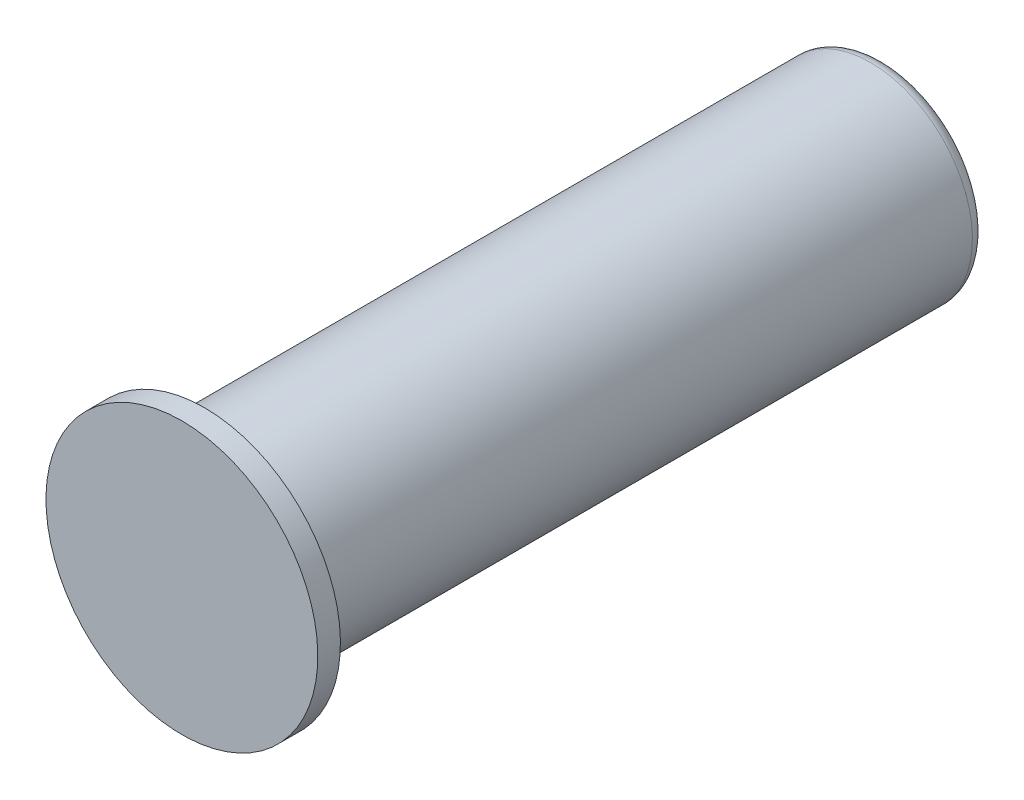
from build123d import *


with BuildPart() as part:
    # Sketch1 → Revolve1 (revolve)
    with BuildSketch(Plane(origin=(0, 0, 0), x_dir=(0, 0, -1), z_dir=(1, 0, 0))):
        with BuildLine():
            Line((0, 0), (0, 30))
            Line((0, 30), (5, 30))
            Line((5, 30), (5, 22.5))
            Line((5, 22.5), (152, 22.5))
            ThreePointArc((152, 22.5), (154.121320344, 21.621320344), (155, 19.5))
            Line((155, 19.5), (155, 4.5))
            Line((155, 4.5), (154.5, 4))
            Line((154.5, 4), (146, 4))
            Line((146, 4), (143.690598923, 0))
            Line((143.690598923, 0), (0, 0))
        make_face()
    revolve(axis=Axis((0, 0, -143.690598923), (0, 0, 1)))


solid = part.part
